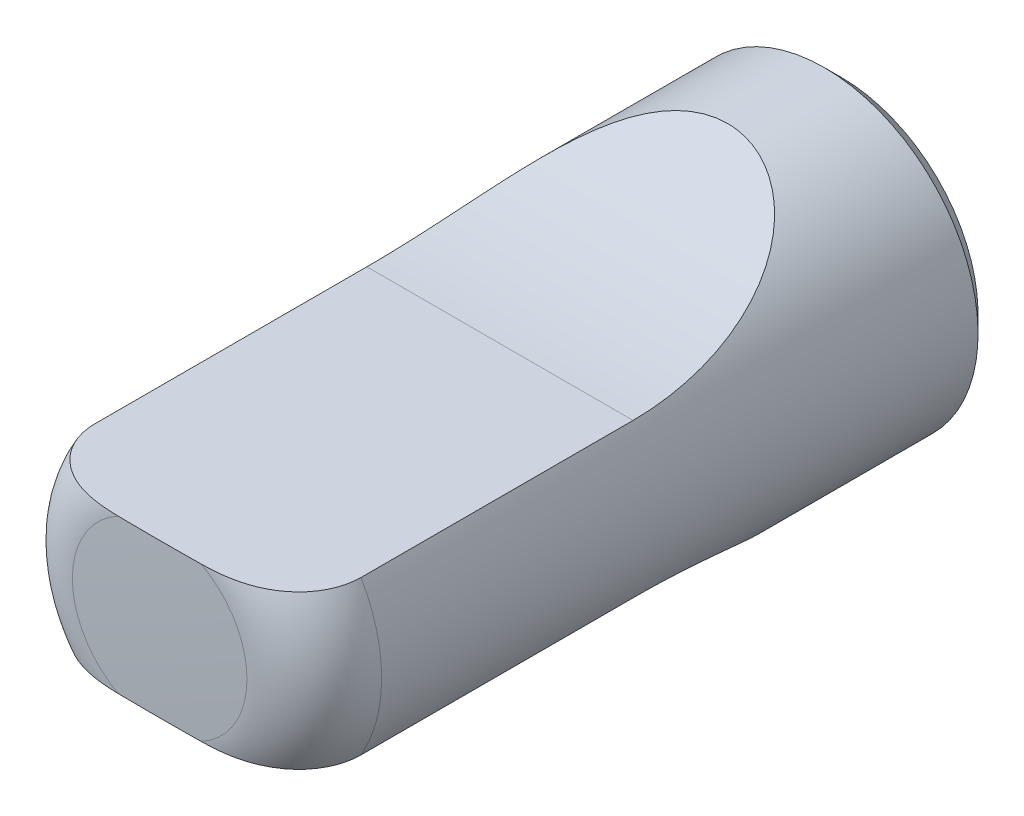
ISO-10303-21;
HEADER;
FILE_DESCRIPTION(('STEP AP214'),'2;1');
FILE_NAME('part.step','',(''),(''),'','','');
FILE_SCHEMA(('AUTOMOTIVE_DESIGN { 1 0 10303 214 1 1 1 1 }'));
ENDSEC;
DATA;
#1=APPLICATION_CONTEXT('core data for automotive mechanical design processes');
#2=APPLICATION_PROTOCOL_DEFINITION('international standard','automotive_design',2000,#1);
#3=PRODUCT_CONTEXT('',#1,'mechanical');
#4=PRODUCT('Part','Part','',(#3));
#5=PRODUCT_RELATED_PRODUCT_CATEGORY('part','',(#4));
#6=PRODUCT_DEFINITION_FORMATION('','',#4);
#7=PRODUCT_DEFINITION_CONTEXT('part definition',#1,'design');
#8=PRODUCT_DEFINITION('design','',#6,#7);
#9=PRODUCT_DEFINITION_SHAPE('','',#8);
#10=(LENGTH_UNIT() NAMED_UNIT(*) SI_UNIT(.MILLI.,.METRE.));
#11=(NAMED_UNIT(*) PLANE_ANGLE_UNIT() SI_UNIT($,.RADIAN.));
#12=(NAMED_UNIT(*) SI_UNIT($,.STERADIAN.) SOLID_ANGLE_UNIT());
#13=UNCERTAINTY_MEASURE_WITH_UNIT(LENGTH_MEASURE(1.E-05),#10,'distance_accuracy_value','');
#14=(GEOMETRIC_REPRESENTATION_CONTEXT(3) GLOBAL_UNCERTAINTY_ASSIGNED_CONTEXT((#13)) GLOBAL_UNIT_ASSIGNED_CONTEXT((#10,
#11,#12)) REPRESENTATION_CONTEXT('',''));
#15=CARTESIAN_POINT('',(0.,0.,0.));
#16=DIRECTION('',(0.,0.,1.));
#17=DIRECTION('',(1.,0.,0.));
#18=AXIS2_PLACEMENT_3D('',#15,#16,#17);
#19=CARTESIAN_POINT('',(4.76832115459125E-13,0.,-69.9999999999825));
#20=DIRECTION('',(0.,0.,-1.));
#21=DIRECTION('',(1.,0.,0.));
#22=AXIS2_PLACEMENT_3D('',#19,#20,#21);
#23=SPHERICAL_SURFACE('',#22,89.9999999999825);
#24=CARTESIAN_POINT('',(0.,0.,19.9636742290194));
#25=DIRECTION('',(0.,0.,-1.));
#26=DIRECTION('',(0.,1.,0.));
#27=AXIS2_PLACEMENT_3D('',#24,#25,#26);
#28=CIRCLE('',#27,2.55681818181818);
#29=CARTESIAN_POINT('',(-1.2144213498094,-2.25,19.9636742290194));
#30=VERTEX_POINT('',#29);
#31=CARTESIAN_POINT('',(-1.2144213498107,2.25,19.9636742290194));
#32=VERTEX_POINT('',#31);
#33=EDGE_CURVE('E135',#30,#32,#28,.T.);
#34=ORIENTED_EDGE('',*,*,#33,.F.);
#35=CARTESIAN_POINT('',(4.76832115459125E-13,-2.25,-69.9999999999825));
#36=DIRECTION('',(0.,-1.,0.));
#37=DIRECTION('',(1.,0.,0.));
#38=AXIS2_PLACEMENT_3D('',#35,#36,#37);
#39=CIRCLE('',#38,89.9718706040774);
#40=CARTESIAN_POINT('',(1.2144213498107,-2.25,19.9636742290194));
#41=VERTEX_POINT('',#40);
#42=EDGE_CURVE('E136',#30,#41,#39,.F.);
#43=ORIENTED_EDGE('',*,*,#42,.T.);
#44=CARTESIAN_POINT('',(1.21442134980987,2.25,19.9636742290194));
#45=VERTEX_POINT('',#44);
#46=EDGE_CURVE('E69',#45,#41,#28,.T.);
#47=ORIENTED_EDGE('',*,*,#46,.F.);
#48=CARTESIAN_POINT('',(4.76832115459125E-13,2.25,-69.9999999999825));
#49=DIRECTION('',(0.,1.,0.));
#50=DIRECTION('',(-1.,0.,0.));
#51=AXIS2_PLACEMENT_3D('',#48,#49,#50);
#52=CIRCLE('',#51,89.9718706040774);
#53=EDGE_CURVE('E139',#45,#32,#52,.F.);
#54=ORIENTED_EDGE('',*,*,#53,.T.);
#55=EDGE_LOOP('',(#34,#43,#47,#54));
#56=FACE_BOUND('',#55,.T.);
#57=ADVANCED_FACE('F14',(#56),#23,.T.);
#58=CARTESIAN_POINT('',(0.,0.,17.9644814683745));
#59=DIRECTION('',(0.,0.,-1.));
#60=DIRECTION('',(0.,1.,0.));
#61=AXIS2_PLACEMENT_3D('',#58,#59,#60);
#62=TOROIDAL_SURFACE('',#61,2.5,2.);
#63=CARTESIAN_POINT('',(0.,0.,17.9644814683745));
#64=DIRECTION('',(0.,0.,-1.));
#65=DIRECTION('',(0.,1.,0.));
#66=AXIS2_PLACEMENT_3D('',#63,#64,#65);
#67=CIRCLE('',#66,4.5);
#68=CARTESIAN_POINT('',(-3.89711431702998,-2.25,17.9644814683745));
#69=VERTEX_POINT('',#68);
#70=CARTESIAN_POINT('',(-3.89711431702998,2.25,17.9644814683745));
#71=VERTEX_POINT('',#70);
#72=EDGE_CURVE('E82',#69,#71,#67,.T.);
#73=ORIENTED_EDGE('',*,*,#72,.F.);
#74=CARTESIAN_POINT('',(0.,-2.25,19.948794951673));
#75=CARTESIAN_POINT('',(0.0949415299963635,-2.25,19.9487984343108));
#76=CARTESIAN_POINT('',(0.18988344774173,-2.25,19.9495840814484));
#77=CARTESIAN_POINT('',(0.379751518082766,-2.25,19.952365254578));
#78=CARTESIAN_POINT('',(0.474677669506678,-2.25,19.9543608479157));
#79=CARTESIAN_POINT('',(0.664734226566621,-2.25,19.9585502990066));
#80=CARTESIAN_POINT('',(0.759864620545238,-2.25,19.9607445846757));
#81=CARTESIAN_POINT('',(0.950164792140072,-2.25,19.9638895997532));
#82=CARTESIAN_POINT('',(1.04533457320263,-2.25,19.9648401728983));
#83=CARTESIAN_POINT('',(1.23470127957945,-2.25,19.9638735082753));
#84=CARTESIAN_POINT('',(1.32889818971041,-2.25,19.9619855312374));
#85=CARTESIAN_POINT('',(1.51708892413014,-2.25,19.95379817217));
#86=CARTESIAN_POINT('',(1.61108281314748,-2.25,19.9475005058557));
#87=CARTESIAN_POINT('',(1.79818020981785,-2.25,19.9290147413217));
#88=CARTESIAN_POINT('',(1.89128569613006,-2.25,19.9168476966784));
#89=CARTESIAN_POINT('',(2.07624146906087,-2.25,19.8852863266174));
#90=CARTESIAN_POINT('',(2.16809261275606,-2.25,19.8658972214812));
#91=CARTESIAN_POINT('',(2.3244461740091,-2.25,19.8252984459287));
#92=CARTESIAN_POINT('',(2.38946721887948,-2.25,19.8060857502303));
#93=CARTESIAN_POINT('',(2.51797735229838,-2.25,19.7629359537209));
#94=CARTESIAN_POINT('',(2.58146554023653,-2.25,19.7389961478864));
#95=CARTESIAN_POINT('',(2.70644041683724,-2.25,19.6860897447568));
#96=CARTESIAN_POINT('',(2.7679239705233,-2.25,19.6571156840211));
#97=CARTESIAN_POINT('',(2.88815849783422,-2.25,19.5940231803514));
#98=CARTESIAN_POINT('',(2.9469103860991,-2.25,19.5599064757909));
#99=CARTESIAN_POINT('',(3.09957810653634,-2.25,19.4616476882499));
#100=CARTESIAN_POINT('',(3.19052378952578,-2.25,19.3927600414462));
#101=CARTESIAN_POINT('',(3.35968229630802,-2.25,19.240837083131));
#102=CARTESIAN_POINT('',(3.43790253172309,-2.25,19.1578100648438));
#103=CARTESIAN_POINT('',(3.57880361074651,-2.25,18.9786395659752));
#104=CARTESIAN_POINT('',(3.64139652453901,-2.25,18.8824263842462));
#105=CARTESIAN_POINT('',(3.74744341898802,-2.25,18.6799451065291));
#106=CARTESIAN_POINT('',(3.79090445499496,-2.25,18.5736807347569));
#107=CARTESIAN_POINT('',(3.85321489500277,-2.25,18.365605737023));
#108=CARTESIAN_POINT('',(3.87407297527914,-2.25,18.2643937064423));
#109=CARTESIAN_POINT('',(3.89753587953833,-2.25,18.0598842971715));
#110=CARTESIAN_POINT('',(3.90014697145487,-2.25,17.9565876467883));
#111=CARTESIAN_POINT('',(3.88733516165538,-2.25,17.756212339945));
#112=CARTESIAN_POINT('',(3.87278650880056,-2.25,17.6590763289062));
#113=CARTESIAN_POINT('',(3.82768306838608,-2.25,17.4686231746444));
#114=CARTESIAN_POINT('',(3.797131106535,-2.25,17.3753053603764));
#115=CARTESIAN_POINT('',(3.72096351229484,-2.25,17.1943409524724));
#116=CARTESIAN_POINT('',(3.67525059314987,-2.25,17.1067354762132));
#117=CARTESIAN_POINT('',(3.5705037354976,-2.25,16.9398844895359));
#118=CARTESIAN_POINT('',(3.51146434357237,-2.25,16.8606424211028));
#119=CARTESIAN_POINT('',(3.37839468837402,-2.25,16.7077845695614));
#120=CARTESIAN_POINT('',(3.30370058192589,-2.25,16.6347490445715));
#121=CARTESIAN_POINT('',(3.14424231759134,-2.25,16.5007352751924));
#122=CARTESIAN_POINT('',(3.05947855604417,-2.25,16.4397565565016));
#123=CARTESIAN_POINT('',(2.91028153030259,-2.25,16.3473696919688));
#124=CARTESIAN_POINT('',(2.84783086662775,-2.25,16.3126910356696));
#125=CARTESIAN_POINT('',(2.72006462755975,-2.25,16.2489784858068));
#126=CARTESIAN_POINT('',(2.6547472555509,-2.25,16.2199481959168));
#127=CARTESIAN_POINT('',(2.52190126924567,-2.25,16.1673161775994));
#128=CARTESIAN_POINT('',(2.45437048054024,-2.25,16.1437199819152));
#129=CARTESIAN_POINT('',(2.31782972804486,-2.25,16.1016702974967));
#130=CARTESIAN_POINT('',(2.24882158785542,-2.25,16.0832108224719));
#131=CARTESIAN_POINT('',(2.06880393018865,-2.25,16.0414731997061));
#132=CARTESIAN_POINT('',(1.95696925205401,-2.25,16.0217493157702));
#133=CARTESIAN_POINT('',(1.73198793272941,-2.25,15.9919140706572));
#134=CARTESIAN_POINT('',(1.61883999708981,-2.25,15.9818131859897));
#135=CARTESIAN_POINT('',(1.2776608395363,-2.25,15.962042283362));
#136=CARTESIAN_POINT('',(1.049131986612,-2.25,15.9631319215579));
#137=CARTESIAN_POINT('',(0.70539760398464,-2.25,15.9693126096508));
#138=CARTESIAN_POINT('',(0.589990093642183,-2.25,15.9721605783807));
#139=CARTESIAN_POINT('',(0.359140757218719,-2.25,15.9769527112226));
#140=CARTESIAN_POINT('',(0.243698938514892,-2.25,15.9788970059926));
#141=CARTESIAN_POINT('',(0.0131399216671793,-2.25,15.9805231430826));
#142=CARTESIAN_POINT('',(-0.101977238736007,-2.25,15.9802115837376));
#143=CARTESIAN_POINT('',(-0.332196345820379,-2.25,15.9775475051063));
#144=CARTESIAN_POINT('',(-0.447298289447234,-2.25,15.9751947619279));
#145=CARTESIAN_POINT('',(-0.617107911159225,-2.25,15.9714675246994));
#146=CARTESIAN_POINT('',(-0.671819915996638,-2.25,15.9702273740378));
#147=CARTESIAN_POINT('',(-0.781246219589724,-2.25,15.967940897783));
#148=CARTESIAN_POINT('',(-0.83596051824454,-2.25,15.966894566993));
#149=CARTESIAN_POINT('',(-1.00020534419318,-2.25,15.9644705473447));
#150=CARTESIAN_POINT('',(-1.10975243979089,-2.25,15.9638105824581));
#151=CARTESIAN_POINT('',(-1.32824968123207,-2.25,15.9668930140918));
#152=CARTESIAN_POINT('',(-1.43719999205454,-2.25,15.9706127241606));
#153=CARTESIAN_POINT('',(-1.65465496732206,-2.25,15.9848666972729));
#154=CARTESIAN_POINT('',(-1.76315984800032,-2.25,15.995397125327));
#155=CARTESIAN_POINT('',(-1.94653474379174,-2.25,16.0209750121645));
#156=CARTESIAN_POINT('',(-2.02172224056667,-2.25,16.0337170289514));
#157=CARTESIAN_POINT('',(-2.17107639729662,-2.25,16.0642957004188));
#158=CARTESIAN_POINT('',(-2.24524299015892,-2.25,16.0821326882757));
#159=CARTESIAN_POINT('',(-2.39206423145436,-2.25,16.1234990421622));
#160=CARTESIAN_POINT('',(-2.46471749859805,-2.25,16.1470333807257));
#161=CARTESIAN_POINT('',(-2.60774365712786,-2.25,16.2002274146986));
#162=CARTESIAN_POINT('',(-2.67811657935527,-2.25,16.2298870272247));
#163=CARTESIAN_POINT('',(-2.8555531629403,-2.25,16.3146656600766));
#164=CARTESIAN_POINT('',(-2.96038728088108,-2.25,16.3746059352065));
#165=CARTESIAN_POINT('',(-3.15875545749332,-2.25,16.5109053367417));
#166=CARTESIAN_POINT('',(-3.25229834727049,-2.25,16.5872515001));
#167=CARTESIAN_POINT('',(-3.42489959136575,-2.25,16.7561370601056));
#168=CARTESIAN_POINT('',(-3.50384880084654,-2.25,16.8487890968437));
#169=CARTESIAN_POINT('',(-3.64245740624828,-2.25,17.0476151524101));
#170=CARTESIAN_POINT('',(-3.70212408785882,-2.25,17.1537840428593));
#171=CARTESIAN_POINT('',(-3.79299445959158,-2.25,17.3624410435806));
#172=CARTESIAN_POINT('',(-3.82677406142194,-2.25,17.4638114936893));
#173=CARTESIAN_POINT('',(-3.87536823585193,-2.25,17.6709844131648));
#174=CARTESIAN_POINT('',(-3.89019378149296,-2.25,17.7767842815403));
#175=CARTESIAN_POINT('',(-3.89984623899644,-2.25,17.9817082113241));
#176=CARTESIAN_POINT('',(-3.89602185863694,-2.25,18.0807712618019));
#177=CARTESIAN_POINT('',(-3.87160380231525,-2.25,18.276795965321));
#178=CARTESIAN_POINT('',(-3.85101238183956,-2.25,18.3737578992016));
#179=CARTESIAN_POINT('',(-3.79418686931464,-2.25,18.5618959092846));
#180=CARTESIAN_POINT('',(-3.75811178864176,-2.25,18.6531202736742));
#181=CARTESIAN_POINT('',(-3.67173419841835,-2.25,18.8285342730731));
#182=CARTESIAN_POINT('',(-3.62143102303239,-2.25,18.9127235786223));
#183=CARTESIAN_POINT('',(-3.50608769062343,-2.25,19.0755006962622));
#184=CARTESIAN_POINT('',(-3.44053169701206,-2.25,19.153721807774));
#185=CARTESIAN_POINT('',(-3.29824571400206,-2.25,19.2992120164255));
#186=CARTESIAN_POINT('',(-3.22151112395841,-2.25,19.3664765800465));
#187=CARTESIAN_POINT('',(-3.05147589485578,-2.25,19.4952305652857));
#188=CARTESIAN_POINT('',(-2.95729239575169,-2.25,19.5555486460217));
#189=CARTESIAN_POINT('',(-2.76137720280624,-2.25,19.6621458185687));
#190=CARTESIAN_POINT('',(-2.65964524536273,-2.25,19.7084244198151));
#191=CARTESIAN_POINT('',(-2.47131879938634,-2.25,19.7801350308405));
#192=CARTESIAN_POINT('',(-2.38557784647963,-2.25,19.8078648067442));
#193=CARTESIAN_POINT('',(-2.2119177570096,-2.25,19.8554972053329));
#194=CARTESIAN_POINT('',(-2.12399737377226,-2.25,19.875395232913));
#195=CARTESIAN_POINT('',(-1.94673202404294,-2.25,19.9083489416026));
#196=CARTESIAN_POINT('',(-1.85738451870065,-2.25,19.9213905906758));
#197=CARTESIAN_POINT('',(-1.67802680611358,-2.25,19.9417463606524));
#198=CARTESIAN_POINT('',(-1.5880163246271,-2.25,19.9490579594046));
#199=CARTESIAN_POINT('',(-1.37339394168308,-2.25,19.9611915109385));
#200=CARTESIAN_POINT('',(-1.24867809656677,-2.25,19.9640004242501));
#201=CARTESIAN_POINT('',(-0.999265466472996,-2.25,19.9648482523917));
#202=CARTESIAN_POINT('',(-0.87456868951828,-2.25,19.962886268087));
#203=CARTESIAN_POINT('',(-0.62485314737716,-2.25,19.9578270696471));
#204=CARTESIAN_POINT('',(-0.499834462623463,-2.25,19.9547266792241));
#205=CARTESIAN_POINT('',(-0.312338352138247,-2.25,19.9513207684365));
#206=CARTESIAN_POINT('',(-0.24987411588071,-2.25,19.9503930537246));
#207=CARTESIAN_POINT('',(-0.124939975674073,-2.25,19.9491290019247));
#208=CARTESIAN_POINT('',(-0.0624700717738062,-2.25,19.9487926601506));
#209=CARTESIAN_POINT('',(0.,-2.25,19.948794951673));
#210=B_SPLINE_CURVE_WITH_KNOTS('',3,(#74,#75,#76,#77,#78,#79,#80,#81,#82,#83,#84,#85,#86,#87,
#88,#89,#90,#91,#92,#93,#94,#95,#96,#97,#98,#99,#100,#101,#102,#103,#104,#105,#106,#107,#108,
#109,#110,#111,#112,#113,#114,#115,#116,#117,#118,#119,#120,#121,#122,#123,#124,#125,#126,#127,
#128,#129,#130,#131,#132,#133,#134,#135,#136,#137,#138,#139,#140,#141,#142,#143,#144,#145,#146,
#147,#148,#149,#150,#151,#152,#153,#154,#155,#156,#157,#158,#159,#160,#161,#162,#163,#164,#165,
#166,#167,#168,#169,#170,#171,#172,#173,#174,#175,#176,#177,#178,#179,#180,#181,#182,#183,#184,
#185,#186,#187,#188,#189,#190,#191,#192,#193,#194,#195,#196,#197,#198,#199,#200,#201,#202,#203,
#204,#205,#206,#207,#208,#209),.UNSPECIFIED.,.T.,.F.,(4,2,2,2,2,2,2,2,2,2,2,2,2,2,2,2,2,2,2,2,2,
2,2,2,2,2,2,2,2,2,2,2,2,2,2,2,2,2,2,2,2,2,2,2,2,2,2,2,2,2,2,2,2,2,2,2,2,2,2,2,2,2,2,2,2,2,2,4),
(0.,0.284823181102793,0.569662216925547,0.855129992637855,1.1406336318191,1.42321431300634,
1.70568510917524,1.98715012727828,2.26841208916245,2.47165324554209,2.675011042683,
2.87867293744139,3.08226614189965,3.42299361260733,3.76352191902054,4.10592514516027,
4.44820199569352,4.75663434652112,5.06496074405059,5.35823373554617,5.65145496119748,
5.94659539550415,6.24185682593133,6.55399046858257,6.86611182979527,7.08014168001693,
7.29430763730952,7.50869069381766,7.72282285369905,8.06293304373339,8.40341308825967,
9.08811394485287,9.43450882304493,9.78085360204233,10.1261857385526,10.4715557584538,
10.6357340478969,10.7999079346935,11.1285119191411,11.4554212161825,11.7821465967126,
12.0107761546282,12.2394206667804,12.4682654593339,12.6971071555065,13.0578408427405,
13.4182905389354,13.7813356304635,14.1442433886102,14.4630975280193,14.7817669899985,
15.0777478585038,15.3736889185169,15.6666608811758,15.9596465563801,16.2645393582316,
16.5695579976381,16.9038097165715,17.2380731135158,17.5080229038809,17.7781308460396,
18.0487894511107,18.3195671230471,18.6936160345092,19.067735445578,19.4429067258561,
19.6303174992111,19.8177267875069),.UNSPECIFIED.);
#211=EDGE_CURVE('E151',#69,#30,#210,.T.);
#212=ORIENTED_EDGE('',*,*,#211,.T.);
#213=ORIENTED_EDGE('',*,*,#33,.T.);
#214=CARTESIAN_POINT('',(0.,2.25,19.948794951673));
#215=CARTESIAN_POINT('',(-0.0949415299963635,2.25,19.9487984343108));
#216=CARTESIAN_POINT('',(-0.18988344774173,2.25,19.9495840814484));
#217=CARTESIAN_POINT('',(-0.379751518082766,2.25,19.952365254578));
#218=CARTESIAN_POINT('',(-0.474677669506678,2.25,19.9543608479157));
#219=CARTESIAN_POINT('',(-0.664734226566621,2.25,19.9585502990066));
#220=CARTESIAN_POINT('',(-0.759864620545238,2.25,19.9607445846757));
#221=CARTESIAN_POINT('',(-0.950164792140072,2.25,19.9638895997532));
#222=CARTESIAN_POINT('',(-1.04533457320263,2.25,19.9648401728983));
#223=CARTESIAN_POINT('',(-1.23470127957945,2.25,19.9638735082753));
#224=CARTESIAN_POINT('',(-1.32889818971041,2.25,19.9619855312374));
#225=CARTESIAN_POINT('',(-1.51708892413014,2.25,19.95379817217));
#226=CARTESIAN_POINT('',(-1.61108281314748,2.25,19.9475005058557));
#227=CARTESIAN_POINT('',(-1.79818020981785,2.25,19.9290147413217));
#228=CARTESIAN_POINT('',(-1.89128569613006,2.25,19.9168476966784));
#229=CARTESIAN_POINT('',(-2.07624146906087,2.25,19.8852863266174));
#230=CARTESIAN_POINT('',(-2.16809261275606,2.25,19.8658972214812));
#231=CARTESIAN_POINT('',(-2.3244461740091,2.25,19.8252984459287));
#232=CARTESIAN_POINT('',(-2.38946721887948,2.25,19.8060857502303));
#233=CARTESIAN_POINT('',(-2.51797735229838,2.25,19.7629359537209));
#234=CARTESIAN_POINT('',(-2.58146554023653,2.25,19.7389961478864));
#235=CARTESIAN_POINT('',(-2.70644041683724,2.25,19.6860897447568));
#236=CARTESIAN_POINT('',(-2.7679239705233,2.25,19.6571156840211));
#237=CARTESIAN_POINT('',(-2.88815849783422,2.25,19.5940231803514));
#238=CARTESIAN_POINT('',(-2.9469103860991,2.25,19.5599064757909));
#239=CARTESIAN_POINT('',(-3.09957810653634,2.25,19.4616476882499));
#240=CARTESIAN_POINT('',(-3.19052378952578,2.25,19.3927600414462));
#241=CARTESIAN_POINT('',(-3.35968229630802,2.25,19.240837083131));
#242=CARTESIAN_POINT('',(-3.43790253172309,2.25,19.1578100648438));
#243=CARTESIAN_POINT('',(-3.57880361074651,2.25,18.9786395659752));
#244=CARTESIAN_POINT('',(-3.64139652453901,2.25,18.8824263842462));
#245=CARTESIAN_POINT('',(-3.74744341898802,2.25,18.6799451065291));
#246=CARTESIAN_POINT('',(-3.79090445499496,2.25,18.5736807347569));
#247=CARTESIAN_POINT('',(-3.85321489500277,2.25,18.365605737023));
#248=CARTESIAN_POINT('',(-3.87407297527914,2.25,18.2643937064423));
#249=CARTESIAN_POINT('',(-3.89753587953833,2.25,18.0598842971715));
#250=CARTESIAN_POINT('',(-3.90014697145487,2.25,17.9565876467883));
#251=CARTESIAN_POINT('',(-3.88733516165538,2.25,17.756212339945));
#252=CARTESIAN_POINT('',(-3.87278650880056,2.25,17.6590763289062));
#253=CARTESIAN_POINT('',(-3.82768306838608,2.25,17.4686231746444));
#254=CARTESIAN_POINT('',(-3.797131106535,2.25,17.3753053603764));
#255=CARTESIAN_POINT('',(-3.72096351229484,2.25,17.1943409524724));
#256=CARTESIAN_POINT('',(-3.67525059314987,2.25,17.1067354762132));
#257=CARTESIAN_POINT('',(-3.5705037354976,2.25,16.9398844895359));
#258=CARTESIAN_POINT('',(-3.51146434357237,2.25,16.8606424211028));
#259=CARTESIAN_POINT('',(-3.37839468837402,2.25,16.7077845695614));
#260=CARTESIAN_POINT('',(-3.30370058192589,2.25,16.6347490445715));
#261=CARTESIAN_POINT('',(-3.14424231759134,2.25,16.5007352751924));
#262=CARTESIAN_POINT('',(-3.05947855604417,2.25,16.4397565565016));
#263=CARTESIAN_POINT('',(-2.91028153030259,2.25,16.3473696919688));
#264=CARTESIAN_POINT('',(-2.84783086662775,2.25,16.3126910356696));
#265=CARTESIAN_POINT('',(-2.72006462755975,2.25,16.2489784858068));
#266=CARTESIAN_POINT('',(-2.6547472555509,2.25,16.2199481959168));
#267=CARTESIAN_POINT('',(-2.52190126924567,2.25,16.1673161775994));
#268=CARTESIAN_POINT('',(-2.45437048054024,2.25,16.1437199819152));
#269=CARTESIAN_POINT('',(-2.31782972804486,2.25,16.1016702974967));
#270=CARTESIAN_POINT('',(-2.24882158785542,2.25,16.0832108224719));
#271=CARTESIAN_POINT('',(-2.06880393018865,2.25,16.0414731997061));
#272=CARTESIAN_POINT('',(-1.95696925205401,2.25,16.0217493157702));
#273=CARTESIAN_POINT('',(-1.73198793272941,2.25,15.9919140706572));
#274=CARTESIAN_POINT('',(-1.61883999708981,2.25,15.9818131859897));
#275=CARTESIAN_POINT('',(-1.2776608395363,2.25,15.962042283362));
#276=CARTESIAN_POINT('',(-1.049131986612,2.25,15.9631319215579));
#277=CARTESIAN_POINT('',(-0.70539760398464,2.25,15.9693126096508));
#278=CARTESIAN_POINT('',(-0.589990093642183,2.25,15.9721605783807));
#279=CARTESIAN_POINT('',(-0.359140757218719,2.25,15.9769527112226));
#280=CARTESIAN_POINT('',(-0.243698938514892,2.25,15.9788970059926));
#281=CARTESIAN_POINT('',(-0.0131399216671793,2.25,15.9805231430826));
#282=CARTESIAN_POINT('',(0.101977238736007,2.25,15.9802115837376));
#283=CARTESIAN_POINT('',(0.332196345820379,2.25,15.9775475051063));
#284=CARTESIAN_POINT('',(0.447298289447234,2.25,15.9751947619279));
#285=CARTESIAN_POINT('',(0.617107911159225,2.25,15.9714675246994));
#286=CARTESIAN_POINT('',(0.671819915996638,2.25,15.9702273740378));
#287=CARTESIAN_POINT('',(0.781246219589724,2.25,15.967940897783));
#288=CARTESIAN_POINT('',(0.83596051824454,2.25,15.966894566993));
#289=CARTESIAN_POINT('',(1.00020534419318,2.25,15.9644705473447));
#290=CARTESIAN_POINT('',(1.10975243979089,2.25,15.9638105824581));
#291=CARTESIAN_POINT('',(1.32824968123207,2.25,15.9668930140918));
#292=CARTESIAN_POINT('',(1.43719999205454,2.25,15.9706127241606));
#293=CARTESIAN_POINT('',(1.65465496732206,2.25,15.9848666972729));
#294=CARTESIAN_POINT('',(1.76315984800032,2.25,15.995397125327));
#295=CARTESIAN_POINT('',(1.94653474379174,2.25,16.0209750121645));
#296=CARTESIAN_POINT('',(2.02172224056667,2.25,16.0337170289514));
#297=CARTESIAN_POINT('',(2.17107639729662,2.25,16.0642957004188));
#298=CARTESIAN_POINT('',(2.24524299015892,2.25,16.0821326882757));
#299=CARTESIAN_POINT('',(2.39206423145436,2.25,16.1234990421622));
#300=CARTESIAN_POINT('',(2.46471749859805,2.25,16.1470333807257));
#301=CARTESIAN_POINT('',(2.60774365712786,2.25,16.2002274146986));
#302=CARTESIAN_POINT('',(2.67811657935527,2.25,16.2298870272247));
#303=CARTESIAN_POINT('',(2.8555531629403,2.25,16.3146656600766));
#304=CARTESIAN_POINT('',(2.96038728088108,2.25,16.3746059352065));
#305=CARTESIAN_POINT('',(3.15875545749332,2.25,16.5109053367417));
#306=CARTESIAN_POINT('',(3.25229834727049,2.25,16.5872515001));
#307=CARTESIAN_POINT('',(3.42489959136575,2.25,16.7561370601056));
#308=CARTESIAN_POINT('',(3.50384880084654,2.25,16.8487890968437));
#309=CARTESIAN_POINT('',(3.64245740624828,2.25,17.0476151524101));
#310=CARTESIAN_POINT('',(3.70212408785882,2.25,17.1537840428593));
#311=CARTESIAN_POINT('',(3.79299445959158,2.25,17.3624410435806));
#312=CARTESIAN_POINT('',(3.82677406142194,2.25,17.4638114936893));
#313=CARTESIAN_POINT('',(3.87536823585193,2.25,17.6709844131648));
#314=CARTESIAN_POINT('',(3.89019378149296,2.25,17.7767842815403));
#315=CARTESIAN_POINT('',(3.89984623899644,2.25,17.9817082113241));
#316=CARTESIAN_POINT('',(3.89602185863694,2.25,18.0807712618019));
#317=CARTESIAN_POINT('',(3.87160380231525,2.25,18.276795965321));
#318=CARTESIAN_POINT('',(3.85101238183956,2.25,18.3737578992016));
#319=CARTESIAN_POINT('',(3.79418686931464,2.25,18.5618959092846));
#320=CARTESIAN_POINT('',(3.75811178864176,2.25,18.6531202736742));
#321=CARTESIAN_POINT('',(3.67173419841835,2.25,18.8285342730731));
#322=CARTESIAN_POINT('',(3.62143102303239,2.25,18.9127235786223));
#323=CARTESIAN_POINT('',(3.50608769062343,2.25,19.0755006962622));
#324=CARTESIAN_POINT('',(3.44053169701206,2.25,19.153721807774));
#325=CARTESIAN_POINT('',(3.29824571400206,2.25,19.2992120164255));
#326=CARTESIAN_POINT('',(3.22151112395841,2.25,19.3664765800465));
#327=CARTESIAN_POINT('',(3.05147589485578,2.25,19.4952305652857));
#328=CARTESIAN_POINT('',(2.95729239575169,2.25,19.5555486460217));
#329=CARTESIAN_POINT('',(2.76137720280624,2.25,19.6621458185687));
#330=CARTESIAN_POINT('',(2.65964524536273,2.25,19.7084244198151));
#331=CARTESIAN_POINT('',(2.47131879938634,2.25,19.7801350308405));
#332=CARTESIAN_POINT('',(2.38557784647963,2.25,19.8078648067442));
#333=CARTESIAN_POINT('',(2.2119177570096,2.25,19.8554972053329));
#334=CARTESIAN_POINT('',(2.12399737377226,2.25,19.875395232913));
#335=CARTESIAN_POINT('',(1.94673202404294,2.25,19.9083489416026));
#336=CARTESIAN_POINT('',(1.85738451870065,2.25,19.9213905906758));
#337=CARTESIAN_POINT('',(1.67802680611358,2.25,19.9417463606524));
#338=CARTESIAN_POINT('',(1.5880163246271,2.25,19.9490579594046));
#339=CARTESIAN_POINT('',(1.37339394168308,2.25,19.9611915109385));
#340=CARTESIAN_POINT('',(1.24867809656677,2.25,19.9640004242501));
#341=CARTESIAN_POINT('',(0.999265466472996,2.25,19.9648482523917));
#342=CARTESIAN_POINT('',(0.87456868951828,2.25,19.962886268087));
#343=CARTESIAN_POINT('',(0.62485314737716,2.25,19.9578270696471));
#344=CARTESIAN_POINT('',(0.499834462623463,2.25,19.9547266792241));
#345=CARTESIAN_POINT('',(0.312338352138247,2.25,19.9513207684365));
#346=CARTESIAN_POINT('',(0.24987411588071,2.25,19.9503930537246));
#347=CARTESIAN_POINT('',(0.124939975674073,2.25,19.9491290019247));
#348=CARTESIAN_POINT('',(0.0624700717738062,2.25,19.9487926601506));
#349=CARTESIAN_POINT('',(0.,2.25,19.948794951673));
#350=B_SPLINE_CURVE_WITH_KNOTS('',3,(#214,#215,#216,#217,#218,#219,#220,#221,#222,#223,#224,
#225,#226,#227,#228,#229,#230,#231,#232,#233,#234,#235,#236,#237,#238,#239,#240,#241,#242,#243,
#244,#245,#246,#247,#248,#249,#250,#251,#252,#253,#254,#255,#256,#257,#258,#259,#260,#261,#262,
#263,#264,#265,#266,#267,#268,#269,#270,#271,#272,#273,#274,#275,#276,#277,#278,#279,#280,#281,
#282,#283,#284,#285,#286,#287,#288,#289,#290,#291,#292,#293,#294,#295,#296,#297,#298,#299,#300,
#301,#302,#303,#304,#305,#306,#307,#308,#309,#310,#311,#312,#313,#314,#315,#316,#317,#318,#319,
#320,#321,#322,#323,#324,#325,#326,#327,#328,#329,#330,#331,#332,#333,#334,#335,#336,#337,#338,
#339,#340,#341,#342,#343,#344,#345,#346,#347,#348,#349),.UNSPECIFIED.,.T.,.F.,(4,2,2,2,2,2,2,2,
2,2,2,2,2,2,2,2,2,2,2,2,2,2,2,2,2,2,2,2,2,2,2,2,2,2,2,2,2,2,2,2,2,2,2,2,2,2,2,2,2,2,2,2,2,2,2,2,
2,2,2,2,2,2,2,2,2,2,2,4),(0.,0.284823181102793,0.569662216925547,0.855129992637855,
1.1406336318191,1.42321431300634,1.70568510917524,1.98715012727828,2.26841208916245,
2.47165324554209,2.675011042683,2.87867293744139,3.08226614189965,3.42299361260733,
3.76352191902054,4.10592514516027,4.44820199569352,4.75663434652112,5.06496074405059,
5.35823373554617,5.65145496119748,5.94659539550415,6.24185682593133,6.55399046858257,
6.86611182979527,7.08014168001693,7.29430763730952,7.50869069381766,7.72282285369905,
8.06293304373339,8.40341308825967,9.08811394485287,9.43450882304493,9.78085360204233,
10.1261857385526,10.4715557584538,10.6357340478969,10.7999079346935,11.1285119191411,
11.4554212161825,11.7821465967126,12.0107761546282,12.2394206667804,12.4682654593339,
12.6971071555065,13.0578408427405,13.4182905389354,13.7813356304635,14.1442433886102,
14.4630975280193,14.7817669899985,15.0777478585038,15.3736889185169,15.6666608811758,
15.9596465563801,16.2645393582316,16.5695579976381,16.9038097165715,17.2380731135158,
17.5080229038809,17.7781308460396,18.0487894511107,18.3195671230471,18.6936160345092,
19.067735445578,19.4429067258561,19.6303174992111,19.8177267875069),.UNSPECIFIED.);
#351=EDGE_CURVE('E163',#32,#71,#350,.T.);
#352=ORIENTED_EDGE('',*,*,#351,.T.);
#353=EDGE_LOOP('',(#73,#212,#213,#352));
#354=FACE_BOUND('',#353,.T.);
#355=ADVANCED_FACE('F125',(#354),#62,.T.);
#356=CARTESIAN_POINT('',(3.89711431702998,2.25,17.9644814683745));
#357=VERTEX_POINT('',#356);
#358=CARTESIAN_POINT('',(3.89711431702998,-2.25,17.9644814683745));
#359=VERTEX_POINT('',#358);
#360=EDGE_CURVE('E141',#357,#359,#67,.T.);
#361=ORIENTED_EDGE('',*,*,#360,.F.);
#362=EDGE_CURVE('E159',#357,#45,#350,.T.);
#363=ORIENTED_EDGE('',*,*,#362,.T.);
#364=ORIENTED_EDGE('',*,*,#46,.T.);
#365=EDGE_CURVE('E153',#41,#359,#210,.T.);
#366=ORIENTED_EDGE('',*,*,#365,.T.);
#367=EDGE_LOOP('',(#361,#363,#364,#366));
#368=FACE_BOUND('',#367,.T.);
#369=ADVANCED_FACE('F120',(#368),#62,.T.);
#370=CARTESIAN_POINT('',(0.,0.,0.));
#371=DIRECTION('',(0.,0.,-1.));
#372=DIRECTION('',(0.,1.,0.));
#373=AXIS2_PLACEMENT_3D('',#370,#371,#372);
#374=CYLINDRICAL_SURFACE('',#373,4.5);
#375=CARTESIAN_POINT('',(0.,0.,0.5));
#376=DIRECTION('',(0.,0.,-1.));
#377=DIRECTION('',(0.,1.,0.));
#378=AXIS2_PLACEMENT_3D('',#375,#376,#377);
#379=CIRCLE('',#378,4.5);
#380=CARTESIAN_POINT('',(0.,4.5,0.5));
#381=VERTEX_POINT('',#380);
#382=EDGE_CURVE('E145',#381,#381,#379,.T.);
#383=ORIENTED_EDGE('',*,*,#382,.F.);
#384=EDGE_LOOP('',(#383));
#385=FACE_BOUND('',#384,.T.);
#386=DIRECTION('',(0.,0.,-1.));
#387=VECTOR('',#386,1.);
#388=CARTESIAN_POINT('',(-3.89711431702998,-2.25,0.));
#389=LINE('',#388,#387);
#390=CARTESIAN_POINT('',(-3.89711431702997,-2.25,10.));
#391=VERTEX_POINT('',#390);
#392=EDGE_CURVE('E9',#69,#391,#389,.T.);
#393=ORIENTED_EDGE('',*,*,#392,.F.);
#394=ORIENTED_EDGE('',*,*,#72,.T.);
#395=DIRECTION('',(0.,0.,-1.));
#396=VECTOR('',#395,1.);
#397=CARTESIAN_POINT('',(-3.89711431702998,2.25,0.));
#398=LINE('',#397,#396);
#399=CARTESIAN_POINT('',(-3.89711431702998,2.25,10.));
#400=VERTEX_POINT('',#399);
#401=EDGE_CURVE('E68',#400,#71,#398,.F.);
#402=ORIENTED_EDGE('',*,*,#401,.F.);
#403=CARTESIAN_POINT('',(3.89711431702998,2.25,10.));
#404=CARTESIAN_POINT('',(3.8971043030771,2.24999774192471,9.87070947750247));
#405=CARTESIAN_POINT('',(3.89579797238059,2.25227944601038,9.74141893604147));
#406=CARTESIAN_POINT('',(3.89052014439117,2.26139424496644,9.48304548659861));
#407=CARTESIAN_POINT('',(3.88654849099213,2.26822760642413,9.35396259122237));
#408=CARTESIAN_POINT('',(3.87585887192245,2.28644383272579,9.09601986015));
#409=CARTESIAN_POINT('',(3.86913649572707,2.29783400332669,8.96716071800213));
#410=CARTESIAN_POINT('',(3.85279700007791,2.32512425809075,8.71011571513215));
#411=CARTESIAN_POINT('',(3.84317993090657,2.34102426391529,8.58192984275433));
#412=CARTESIAN_POINT('',(3.80946871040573,2.39579911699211,8.19604699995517));
#413=CARTESIAN_POINT('',(3.78061638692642,2.44156068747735,7.93968648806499));
#414=CARTESIAN_POINT('',(3.70794886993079,2.55057216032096,7.43304102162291));
#415=CARTESIAN_POINT('',(3.66414639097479,2.61380719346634,7.18275109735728));
#416=CARTESIAN_POINT('',(3.57788836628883,2.72979444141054,6.78269120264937));
#417=CARTESIAN_POINT('',(3.54103324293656,2.77764880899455,6.63027363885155));
#418=CARTESIAN_POINT('',(3.45897897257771,2.87919032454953,6.32965213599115));
#419=CARTESIAN_POINT('',(3.4137798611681,2.9328774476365,6.18144817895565));
#420=CARTESIAN_POINT('',(3.31399547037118,3.04516898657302,5.89078907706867));
#421=CARTESIAN_POINT('',(3.25944380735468,3.10375541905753,5.74831552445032));
#422=CARTESIAN_POINT('',(3.13951578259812,3.22501351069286,5.46980329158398));
#423=CARTESIAN_POINT('',(3.07414285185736,3.28768387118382,5.33376258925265));
#424=CARTESIAN_POINT('',(2.95064463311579,3.39831820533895,5.10553324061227));
#425=CARTESIAN_POINT('',(2.89538483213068,3.44564551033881,5.0114819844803));
#426=CARTESIAN_POINT('',(2.77789260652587,3.54105064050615,4.82825360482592));
#427=CARTESIAN_POINT('',(2.71566201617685,3.58912826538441,4.73907520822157));
#428=CARTESIAN_POINT('',(2.58380881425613,3.68518331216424,4.56639793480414));
#429=CARTESIAN_POINT('',(2.51419199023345,3.73316078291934,4.48289469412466));
#430=CARTESIAN_POINT('',(2.36722372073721,3.82804154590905,4.32237695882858));
#431=CARTESIAN_POINT('',(2.28987416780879,3.87494509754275,4.24536088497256));
#432=CARTESIAN_POINT('',(2.08176360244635,3.99216957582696,4.05772227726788));
#433=CARTESIAN_POINT('',(1.94528726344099,4.06094945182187,3.95233437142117));
#434=CARTESIAN_POINT('',(1.65351428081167,4.18820974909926,3.76325233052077));
#435=CARTESIAN_POINT('',(1.4982238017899,4.24669352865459,3.67955111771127));
#436=CARTESIAN_POINT('',(1.25281023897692,4.32295520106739,3.57272897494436));
#437=CARTESIAN_POINT('',(1.16849907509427,4.34654868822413,3.54013466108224));
#438=CARTESIAN_POINT('',(0.99644714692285,4.38918298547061,3.48177723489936));
#439=CARTESIAN_POINT('',(0.908708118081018,4.40822606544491,3.45601071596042));
#440=CARTESIAN_POINT('',(0.730534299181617,4.44123065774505,3.41165049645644));
#441=CARTESIAN_POINT('',(0.640100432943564,4.45519389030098,3.39305436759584));
#442=CARTESIAN_POINT('',(0.457353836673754,4.47764407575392,3.36327476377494));
#443=CARTESIAN_POINT('',(0.365041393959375,4.48613185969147,3.35209016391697));
#444=CARTESIAN_POINT('',(0.192020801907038,4.49662039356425,3.3382879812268));
#445=CARTESIAN_POINT('',(0.111430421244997,4.49934281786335,3.33471687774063));
#446=CARTESIAN_POINT('',(-0.0498604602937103,4.50044657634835,3.33326794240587));
#447=CARTESIAN_POINT('',(-0.13056098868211,4.49882648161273,3.33539198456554));
#448=CARTESIAN_POINT('',(-0.291356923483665,4.4912783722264,3.34531479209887));
#449=CARTESIAN_POINT('',(-0.371452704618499,4.48535329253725,3.35310969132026));
#450=CARTESIAN_POINT('',(-0.530491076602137,4.46933807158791,3.37428148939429));
#451=CARTESIAN_POINT('',(-0.609433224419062,4.45924637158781,3.38766047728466));
#452=CARTESIAN_POINT('',(-0.836700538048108,4.42409719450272,3.4345630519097));
#453=CARTESIAN_POINT('',(-0.982806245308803,4.39377715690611,3.47533987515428));
#454=CARTESIAN_POINT('',(-1.26517899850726,4.32095533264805,3.57536440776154));
#455=CARTESIAN_POINT('',(-1.40144461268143,4.27845177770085,3.63461479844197));
#456=CARTESIAN_POINT('',(-1.67187716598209,4.18055546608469,3.77480871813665));
#457=CARTESIAN_POINT('',(-1.80509590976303,4.12442817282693,3.85705959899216));
#458=CARTESIAN_POINT('',(-2.05624536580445,4.00515014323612,4.03808157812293));
#459=CARTESIAN_POINT('',(-2.17416817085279,3.94199580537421,4.13686116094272));
#460=CARTESIAN_POINT('',(-2.36866844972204,3.82740114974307,4.32341019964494));
#461=CARTESIAN_POINT('',(-2.44845778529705,3.77668550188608,4.40833211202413));
#462=CARTESIAN_POINT('',(-2.59932464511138,3.67448169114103,4.58521665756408));
#463=CARTESIAN_POINT('',(-2.67039846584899,3.6229932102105,4.67718225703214));
#464=CARTESIAN_POINT('',(-2.80437891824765,3.5203122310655,4.86727491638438));
#465=CARTESIAN_POINT('',(-2.86727175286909,3.46912036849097,4.96541198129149));
#466=CARTESIAN_POINT('',(-2.985372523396,3.36802486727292,5.16685562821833));
#467=CARTESIAN_POINT('',(-3.04057795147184,3.31812165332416,5.27016388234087));
#468=CARTESIAN_POINT('',(-3.1681874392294,3.19742590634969,5.53067297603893));
#469=CARTESIAN_POINT('',(-3.2365144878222,3.12781313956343,5.69042549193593));
#470=CARTESIAN_POINT('',(-3.36001926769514,2.994746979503,6.01741291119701));
#471=CARTESIAN_POINT('',(-3.41519062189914,2.93129658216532,6.18465139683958));
#472=CARTESIAN_POINT('',(-3.51440227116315,2.81158965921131,6.52547695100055));
#473=CARTESIAN_POINT('',(-3.55840886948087,2.75535515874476,6.69908147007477));
#474=CARTESIAN_POINT('',(-3.63673631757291,2.65111187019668,7.05088918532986));
#475=CARTESIAN_POINT('',(-3.67105522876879,2.60310472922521,7.22909329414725));
#476=CARTESIAN_POINT('',(-3.73655892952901,2.50838617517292,7.61991799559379));
#477=CARTESIAN_POINT('',(-3.76619447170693,2.46331177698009,7.83319541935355));
#478=CARTESIAN_POINT('',(-3.81577562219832,2.38578396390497,8.26317232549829));
#479=CARTESIAN_POINT('',(-3.83571849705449,2.35333410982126,8.47987275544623));
#480=CARTESIAN_POINT('',(-3.86695486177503,2.30164420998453,8.91339898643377));
#481=CARTESIAN_POINT('',(-3.87832771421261,2.28228313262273,9.13020455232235));
#482=CARTESIAN_POINT('',(-3.88963398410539,2.26291714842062,9.45607538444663));
#483=CARTESIAN_POINT('',(-3.89244392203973,2.25807442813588,9.56478183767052));
#484=CARTESIAN_POINT('',(-3.89618206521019,2.25161571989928,9.78232260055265));
#485=CARTESIAN_POINT('',(-3.89711027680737,2.2499997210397,9.89115690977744));
#486=CARTESIAN_POINT('',(-3.89711431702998,2.25,10.));
#487=B_SPLINE_CURVE_WITH_KNOTS('',3,(#403,#404,#405,#406,#407,#408,#409,#410,#411,#412,#413,
#414,#415,#416,#417,#418,#419,#420,#421,#422,#423,#424,#425,#426,#427,#428,#429,#430,#431,#432,
#433,#434,#435,#436,#437,#438,#439,#440,#441,#442,#443,#444,#445,#446,#447,#448,#449,#450,#451,
#452,#453,#454,#455,#456,#457,#458,#459,#460,#461,#462,#463,#464,#465,#466,#467,#468,#469,#470,
#471,#472,#473,#474,#475,#476,#477,#478,#479,#480,#481,#482,#483,#484,#485,#486),.UNSPECIFIED.,
.F.,.F.,(4,2,2,2,2,2,2,2,2,2,2,2,2,2,2,2,2,2,2,2,2,2,2,2,2,2,2,2,2,2,2,2,2,2,2,2,2,2,2,2,2,4),
(0.,0.387844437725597,0.775711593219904,1.16420310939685,1.55268787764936,2.33764243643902,
3.12193107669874,3.61346401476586,4.1049948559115,4.59479464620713,5.08443943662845,
5.44089574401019,5.79725847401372,6.15334400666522,6.50934260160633,7.06403601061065,
7.61854815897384,7.89845331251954,8.1782185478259,8.45788895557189,8.73751690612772,
8.97935410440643,9.22127088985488,9.46302290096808,9.70486543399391,10.1667391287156,
10.6286798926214,11.1257610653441,11.6230981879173,12.0038449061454,12.3847528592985,
12.7662950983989,13.1479615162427,13.7086308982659,14.2695715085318,14.8321854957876,
15.3949119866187,16.054234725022,16.7137432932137,17.3670667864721,17.6935634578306,
18.0200590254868),.UNSPECIFIED.);
#488=CARTESIAN_POINT('',(3.89711431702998,2.25,10.));
#489=VERTEX_POINT('',#488);
#490=EDGE_CURVE('E63',#489,#400,#487,.T.);
#491=ORIENTED_EDGE('',*,*,#490,.F.);
#492=DIRECTION('',(0.,0.,-1.));
#493=VECTOR('',#492,1.);
#494=CARTESIAN_POINT('',(3.89711431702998,2.25,0.));
#495=LINE('',#494,#493);
#496=EDGE_CURVE('E75',#357,#489,#495,.T.);
#497=ORIENTED_EDGE('',*,*,#496,.F.);
#498=ORIENTED_EDGE('',*,*,#360,.T.);
#499=DIRECTION('',(0.,0.,-1.));
#500=VECTOR('',#499,1.);
#501=CARTESIAN_POINT('',(3.89711431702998,-2.25,0.));
#502=LINE('',#501,#500);
#503=CARTESIAN_POINT('',(3.89711431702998,-2.25,10.));
#504=VERTEX_POINT('',#503);
#505=EDGE_CURVE('E84',#504,#359,#502,.F.);
#506=ORIENTED_EDGE('',*,*,#505,.F.);
#507=CARTESIAN_POINT('',(-3.89711431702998,-2.25,10.));
#508=CARTESIAN_POINT('',(-3.8971043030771,-2.24999774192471,9.87070947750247));
#509=CARTESIAN_POINT('',(-3.89579797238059,-2.25227944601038,9.74141893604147));
#510=CARTESIAN_POINT('',(-3.89052014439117,-2.26139424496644,9.48304548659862));
#511=CARTESIAN_POINT('',(-3.88654849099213,-2.26822760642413,9.35396259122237));
#512=CARTESIAN_POINT('',(-3.87585887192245,-2.28644383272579,9.09601986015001));
#513=CARTESIAN_POINT('',(-3.86913649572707,-2.29783400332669,8.96716071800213));
#514=CARTESIAN_POINT('',(-3.85279700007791,-2.32512425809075,8.71011571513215));
#515=CARTESIAN_POINT('',(-3.84317993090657,-2.34102426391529,8.58192984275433));
#516=CARTESIAN_POINT('',(-3.80946871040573,-2.39579911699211,8.19604699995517));
#517=CARTESIAN_POINT('',(-3.78061638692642,-2.44156068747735,7.93968648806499));
#518=CARTESIAN_POINT('',(-3.70794886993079,-2.55057216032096,7.43304102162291));
#519=CARTESIAN_POINT('',(-3.66414639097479,-2.61380719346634,7.18275109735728));
#520=CARTESIAN_POINT('',(-3.57788836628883,-2.72979444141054,6.78269120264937));
#521=CARTESIAN_POINT('',(-3.54103324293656,-2.77764880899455,6.63027363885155));
#522=CARTESIAN_POINT('',(-3.45897897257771,-2.87919032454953,6.32965213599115));
#523=CARTESIAN_POINT('',(-3.4137798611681,-2.9328774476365,6.18144817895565));
#524=CARTESIAN_POINT('',(-3.31399547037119,-3.04516898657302,5.89078907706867));
#525=CARTESIAN_POINT('',(-3.25944380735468,-3.10375541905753,5.74831552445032));
#526=CARTESIAN_POINT('',(-3.13951578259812,-3.22501351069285,5.46980329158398));
#527=CARTESIAN_POINT('',(-3.07414285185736,-3.28768387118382,5.33376258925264));
#528=CARTESIAN_POINT('',(-2.95064463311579,-3.39831820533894,5.10553324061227));
#529=CARTESIAN_POINT('',(-2.89538483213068,-3.44564551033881,5.0114819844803));
#530=CARTESIAN_POINT('',(-2.77789260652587,-3.54105064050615,4.82825360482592));
#531=CARTESIAN_POINT('',(-2.71566201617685,-3.5891282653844,4.73907520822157));
#532=CARTESIAN_POINT('',(-2.58380881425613,-3.68518331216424,4.56639793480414));
#533=CARTESIAN_POINT('',(-2.51419199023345,-3.73316078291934,4.48289469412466));
#534=CARTESIAN_POINT('',(-2.36722372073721,-3.82804154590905,4.32237695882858));
#535=CARTESIAN_POINT('',(-2.2898741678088,-3.87494509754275,4.24536088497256));
#536=CARTESIAN_POINT('',(-2.08176360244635,-3.99216957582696,4.05772227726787));
#537=CARTESIAN_POINT('',(-1.945287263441,-4.06094945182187,3.95233437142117));
#538=CARTESIAN_POINT('',(-1.65351428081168,-4.18820974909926,3.76325233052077));
#539=CARTESIAN_POINT('',(-1.4982238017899,-4.24669352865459,3.67955111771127));
#540=CARTESIAN_POINT('',(-1.25281023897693,-4.32295520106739,3.57272897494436));
#541=CARTESIAN_POINT('',(-1.16849907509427,-4.34654868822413,3.54013466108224));
#542=CARTESIAN_POINT('',(-0.996447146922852,-4.38918298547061,3.48177723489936));
#543=CARTESIAN_POINT('',(-0.908708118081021,-4.40822606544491,3.45601071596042));
#544=CARTESIAN_POINT('',(-0.730534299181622,-4.44123065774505,3.41165049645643));
#545=CARTESIAN_POINT('',(-0.640100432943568,-4.45519389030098,3.39305436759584));
#546=CARTESIAN_POINT('',(-0.457353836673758,-4.47764407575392,3.36327476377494));
#547=CARTESIAN_POINT('',(-0.36504139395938,-4.48613185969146,3.35209016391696));
#548=CARTESIAN_POINT('',(-0.192020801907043,-4.49662039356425,3.33828798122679));
#549=CARTESIAN_POINT('',(-0.111430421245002,-4.49934281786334,3.33471687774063));
#550=CARTESIAN_POINT('',(0.0498604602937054,-4.50044657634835,3.33326794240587));
#551=CARTESIAN_POINT('',(0.130560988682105,-4.49882648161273,3.33539198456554));
#552=CARTESIAN_POINT('',(0.29135692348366,-4.4912783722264,3.34531479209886));
#553=CARTESIAN_POINT('',(0.371452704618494,-4.48535329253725,3.35310969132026));
#554=CARTESIAN_POINT('',(0.530491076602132,-4.46933807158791,3.37428148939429));
#555=CARTESIAN_POINT('',(0.609433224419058,-4.45924637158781,3.38766047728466));
#556=CARTESIAN_POINT('',(0.836700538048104,-4.42409719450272,3.43456305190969));
#557=CARTESIAN_POINT('',(0.982806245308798,-4.39377715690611,3.47533987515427));
#558=CARTESIAN_POINT('',(1.26517899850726,-4.32095533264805,3.57536440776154));
#559=CARTESIAN_POINT('',(1.40144461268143,-4.27845177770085,3.63461479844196));
#560=CARTESIAN_POINT('',(1.67187716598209,-4.18055546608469,3.77480871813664));
#561=CARTESIAN_POINT('',(1.80509590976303,-4.12442817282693,3.85705959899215));
#562=CARTESIAN_POINT('',(2.05624536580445,-4.00515014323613,4.03808157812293));
#563=CARTESIAN_POINT('',(2.17416817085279,-3.94199580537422,4.13686116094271));
#564=CARTESIAN_POINT('',(2.36866844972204,-3.82740114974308,4.32341019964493));
#565=CARTESIAN_POINT('',(2.44845778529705,-3.77668550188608,4.40833211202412));
#566=CARTESIAN_POINT('',(2.59932464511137,-3.67448169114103,4.58521665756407));
#567=CARTESIAN_POINT('',(2.67039846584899,-3.62299321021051,4.67718225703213));
#568=CARTESIAN_POINT('',(2.80437891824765,-3.52031223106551,4.86727491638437));
#569=CARTESIAN_POINT('',(2.86727175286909,-3.46912036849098,4.96541198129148));
#570=CARTESIAN_POINT('',(2.985372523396,-3.36802486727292,5.16685562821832));
#571=CARTESIAN_POINT('',(3.04057795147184,-3.31812165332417,5.27016388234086));
#572=CARTESIAN_POINT('',(3.16818743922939,-3.19742590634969,5.53067297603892));
#573=CARTESIAN_POINT('',(3.23651448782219,-3.12781313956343,5.69042549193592));
#574=CARTESIAN_POINT('',(3.36001926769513,-2.994746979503,6.017412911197));
#575=CARTESIAN_POINT('',(3.41519062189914,-2.93129658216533,6.18465139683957));
#576=CARTESIAN_POINT('',(3.51440227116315,-2.81158965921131,6.52547695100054));
#577=CARTESIAN_POINT('',(3.55840886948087,-2.75535515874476,6.69908147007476));
#578=CARTESIAN_POINT('',(3.63673631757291,-2.65111187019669,7.05088918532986));
#579=CARTESIAN_POINT('',(3.67105522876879,-2.60310472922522,7.22909329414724));
#580=CARTESIAN_POINT('',(3.73655892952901,-2.50838617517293,7.61991799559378));
#581=CARTESIAN_POINT('',(3.76619447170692,-2.46331177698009,7.83319541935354));
#582=CARTESIAN_POINT('',(3.81577562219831,-2.38578396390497,8.26317232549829));
#583=CARTESIAN_POINT('',(3.83571849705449,-2.35333410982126,8.47987275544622));
#584=CARTESIAN_POINT('',(3.86695486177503,-2.30164420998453,8.91339898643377));
#585=CARTESIAN_POINT('',(3.87832771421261,-2.28228313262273,9.13020455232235));
#586=CARTESIAN_POINT('',(3.88963398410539,-2.26291714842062,9.45607538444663));
#587=CARTESIAN_POINT('',(3.89244392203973,-2.25807442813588,9.56478183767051));
#588=CARTESIAN_POINT('',(3.89618206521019,-2.25161571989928,9.78232260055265));
#589=CARTESIAN_POINT('',(3.89711027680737,-2.2499997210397,9.89115690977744));
#590=CARTESIAN_POINT('',(3.89711431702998,-2.25,10.));
#591=B_SPLINE_CURVE_WITH_KNOTS('',3,(#507,#508,#509,#510,#511,#512,#513,#514,#515,#516,#517,
#518,#519,#520,#521,#522,#523,#524,#525,#526,#527,#528,#529,#530,#531,#532,#533,#534,#535,#536,
#537,#538,#539,#540,#541,#542,#543,#544,#545,#546,#547,#548,#549,#550,#551,#552,#553,#554,#555,
#556,#557,#558,#559,#560,#561,#562,#563,#564,#565,#566,#567,#568,#569,#570,#571,#572,#573,#574,
#575,#576,#577,#578,#579,#580,#581,#582,#583,#584,#585,#586,#587,#588,#589,#590),.UNSPECIFIED.,
.F.,.F.,(4,2,2,2,2,2,2,2,2,2,2,2,2,2,2,2,2,2,2,2,2,2,2,2,2,2,2,2,2,2,2,2,2,2,2,2,2,2,2,2,2,4),
(0.,0.387844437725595,0.775711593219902,1.16420310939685,1.55268787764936,2.33764243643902,
3.12193107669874,3.61346401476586,4.1049948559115,4.59479464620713,5.08443943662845,
5.44089574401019,5.79725847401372,6.15334400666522,6.50934260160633,7.06403601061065,
7.61854815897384,7.89845331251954,8.1782185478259,8.45788895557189,8.73751690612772,
8.97935410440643,9.22127088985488,9.46302290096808,9.70486543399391,10.1667391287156,
10.6286798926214,11.1257610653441,11.6230981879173,12.0038449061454,12.3847528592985,
12.7662950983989,13.1479615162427,13.7086308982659,14.2695715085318,14.8321854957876,
15.3949119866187,16.054234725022,16.7137432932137,17.3670667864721,17.6935634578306,
18.0200590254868),.UNSPECIFIED.);
#592=EDGE_CURVE('E21',#391,#504,#591,.T.);
#593=ORIENTED_EDGE('',*,*,#592,.F.);
#594=EDGE_LOOP('',(#393,#394,#402,#491,#497,#498,#506,#593));
#595=FACE_BOUND('',#594,.T.);
#596=ADVANCED_FACE('F80',(#385,#595),#374,.T.);
#597=CARTESIAN_POINT('',(0.,0.,0.5));
#598=DIRECTION('',(0.,0.,1.));
#599=DIRECTION('',(0.,-1.,0.));
#600=AXIS2_PLACEMENT_3D('',#597,#598,#599);
#601=CONICAL_SURFACE('',#600,4.5,0.785398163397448);
#602=CARTESIAN_POINT('',(0.,0.,0.));
#603=DIRECTION('',(0.,0.,-1.));
#604=DIRECTION('',(0.,1.,0.));
#605=AXIS2_PLACEMENT_3D('',#602,#603,#604);
#606=CIRCLE('',#605,4.);
#607=CARTESIAN_POINT('',(0.,4.,0.));
#608=VERTEX_POINT('',#607);
#609=EDGE_CURVE('E148',#608,#608,#606,.T.);
#610=ORIENTED_EDGE('',*,*,#609,.F.);
#611=EDGE_LOOP('',(#610));
#612=FACE_BOUND('',#611,.T.);
#613=ORIENTED_EDGE('',*,*,#382,.T.);
#614=EDGE_LOOP('',(#613));
#615=FACE_BOUND('',#614,.T.);
#616=ADVANCED_FACE('F112',(#612,#615),#601,.T.);
#617=CARTESIAN_POINT('',(4.,0.,0.));
#618=DIRECTION('',(0.,0.,1.));
#619=DIRECTION('',(0.,-1.,0.));
#620=AXIS2_PLACEMENT_3D('',#617,#618,#619);
#621=PLANE('',#620);
#622=CARTESIAN_POINT('',(0.,0.,0.));
#623=DIRECTION('',(0.,0.,-1.));
#624=DIRECTION('',(0.,1.,0.));
#625=AXIS2_PLACEMENT_3D('',#622,#623,#624);
#626=CIRCLE('',#625,2.);
#627=CARTESIAN_POINT('',(0.,2.,0.));
#628=VERTEX_POINT('',#627);
#629=EDGE_CURVE('E185',#628,#628,#626,.T.);
#630=ORIENTED_EDGE('',*,*,#629,.F.);
#631=EDGE_LOOP('',(#630));
#632=FACE_BOUND('',#631,.T.);
#633=ORIENTED_EDGE('',*,*,#609,.T.);
#634=EDGE_LOOP('',(#633));
#635=FACE_BOUND('',#634,.T.);
#636=ADVANCED_FACE('F110',(#632,#635),#621,.F.);
#637=CARTESIAN_POINT('',(50.,13.25,10.));
#638=DIRECTION('',(-1.,0.,0.));
#639=DIRECTION('',(0.,-1.,0.));
#640=AXIS2_PLACEMENT_3D('',#637,#638,#639);
#641=CYLINDRICAL_SURFACE('',#640,11.);
#642=ORIENTED_EDGE('',*,*,#490,.T.);
#643=DIRECTION('',(-1.,0.,0.));
#644=VECTOR('',#643,1.);
#645=CARTESIAN_POINT('',(50.,2.25,10.));
#646=LINE('',#645,#644);
#647=EDGE_CURVE('E34',#489,#400,#646,.T.);
#648=ORIENTED_EDGE('',*,*,#647,.F.);
#649=EDGE_LOOP('',(#642,#648));
#650=FACE_BOUND('',#649,.T.);
#651=ADVANCED_FACE('F64',(#650),#641,.F.);
#652=CARTESIAN_POINT('',(50.,2.25,20.));
#653=DIRECTION('',(0.,1.,0.));
#654=DIRECTION('',(-1.,0.,0.));
#655=AXIS2_PLACEMENT_3D('',#652,#653,#654);
#656=PLANE('',#655);
#657=ORIENTED_EDGE('',*,*,#496,.T.);
#658=ORIENTED_EDGE('',*,*,#647,.T.);
#659=ORIENTED_EDGE('',*,*,#401,.T.);
#660=ORIENTED_EDGE('',*,*,#351,.F.);
#661=ORIENTED_EDGE('',*,*,#53,.F.);
#662=ORIENTED_EDGE('',*,*,#362,.F.);
#663=EDGE_LOOP('',(#657,#658,#659,#660,#661,#662));
#664=FACE_BOUND('',#663,.T.);
#665=ADVANCED_FACE('F72',(#664),#656,.T.);
#666=CARTESIAN_POINT('',(50.,-13.25,10.));
#667=DIRECTION('',(-1.,0.,0.));
#668=DIRECTION('',(0.,-1.,0.));
#669=AXIS2_PLACEMENT_3D('',#666,#667,#668);
#670=CYLINDRICAL_SURFACE('',#669,11.);
#671=ORIENTED_EDGE('',*,*,#592,.T.);
#672=DIRECTION('',(-1.,0.,0.));
#673=VECTOR('',#672,1.);
#674=CARTESIAN_POINT('',(50.,-2.25,10.));
#675=LINE('',#674,#673);
#676=EDGE_CURVE('E27',#504,#391,#675,.T.);
#677=ORIENTED_EDGE('',*,*,#676,.T.);
#678=EDGE_LOOP('',(#671,#677));
#679=FACE_BOUND('',#678,.T.);
#680=ADVANCED_FACE('F101',(#679),#670,.F.);
#681=CARTESIAN_POINT('',(50.,-2.25,10.));
#682=DIRECTION('',(0.,-1.,0.));
#683=DIRECTION('',(1.,0.,0.));
#684=AXIS2_PLACEMENT_3D('',#681,#682,#683);
#685=PLANE('',#684);
#686=ORIENTED_EDGE('',*,*,#392,.T.);
#687=ORIENTED_EDGE('',*,*,#676,.F.);
#688=ORIENTED_EDGE('',*,*,#505,.T.);
#689=ORIENTED_EDGE('',*,*,#365,.F.);
#690=ORIENTED_EDGE('',*,*,#42,.F.);
#691=ORIENTED_EDGE('',*,*,#211,.F.);
#692=EDGE_LOOP('',(#686,#687,#688,#689,#690,#691));
#693=FACE_BOUND('',#692,.T.);
#694=ADVANCED_FACE('F106',(#693),#685,.T.);
#695=CARTESIAN_POINT('',(0.,0.,6.));
#696=DIRECTION('',(0.,0.,-1.));
#697=DIRECTION('',(0.,1.,0.));
#698=AXIS2_PLACEMENT_3D('',#695,#696,#697);
#699=PLANE('',#698);
#700=CARTESIAN_POINT('',(0.,0.,6.));
#701=DIRECTION('',(0.,0.,-1.));
#702=DIRECTION('',(0.,1.,0.));
#703=AXIS2_PLACEMENT_3D('',#700,#701,#702);
#704=CIRCLE('',#703,2.);
#705=CARTESIAN_POINT('',(0.,2.,6.));
#706=VERTEX_POINT('',#705);
#707=EDGE_CURVE('E76',#706,#706,#704,.T.);
#708=ORIENTED_EDGE('',*,*,#707,.T.);
#709=EDGE_LOOP('',(#708));
#710=FACE_BOUND('',#709,.T.);
#711=ADVANCED_FACE('F176',(#710),#699,.T.);
#712=CARTESIAN_POINT('',(0.,0.,6.));
#713=DIRECTION('',(0.,0.,-1.));
#714=DIRECTION('',(0.,1.,0.));
#715=AXIS2_PLACEMENT_3D('',#712,#713,#714);
#716=CYLINDRICAL_SURFACE('',#715,2.);
#717=ORIENTED_EDGE('',*,*,#707,.F.);
#718=EDGE_LOOP('',(#717));
#719=FACE_BOUND('',#718,.T.);
#720=ORIENTED_EDGE('',*,*,#629,.T.);
#721=EDGE_LOOP('',(#720));
#722=FACE_BOUND('',#721,.T.);
#723=ADVANCED_FACE('F173',(#719,#722),#716,.F.);
#724=CLOSED_SHELL('',(#57,#355,#369,#596,#616,#636,#651,#665,#680,#694,#711,#723));
#725=MANIFOLD_SOLID_BREP('B1',#724);
#726=ADVANCED_BREP_SHAPE_REPRESENTATION('',(#18,#725),#14);
#727=SHAPE_DEFINITION_REPRESENTATION(#9,#726);
ENDSEC;
END-ISO-10303-21;
